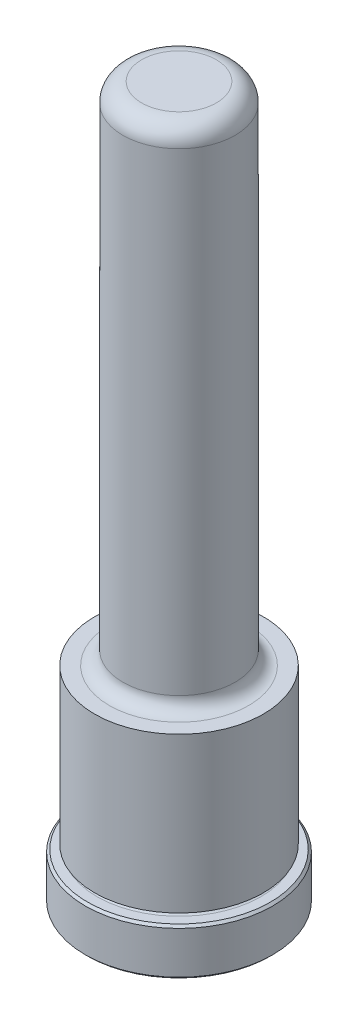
from build123d import *

# Parameters (mm, degrees)
CHAMFER1_SIZE = 0.381
FILLET1_R     = 3.175


with BuildPart() as part:
    # Sketch1 → Revolve1 (revolve)
    with BuildSketch(Plane(origin=(0, 0, 0), x_dir=(0, 0, -1), z_dir=(1, 0, 0)), mode=Mode.PRIVATE) as revolve1_sk:
        with BuildLine():
            Line((0, 0), (15.875, 0))
            Line((15.875, 0), (15.875, 7.9248))
            Line((15.875, 7.9248), (13.8938, 7.9248))
            ThreePointArc((13.8938, 7.9248), (13.5128, 8.3058), (13.8938, 8.6868))
            Line((13.8938, 8.6868), (14.3002, 8.6868))
            Line((14.3002, 8.6868), (14.3002, 34.925))
            Line((14.3002, 34.925), (11.7983, 34.925))
            ThreePointArc((11.7983, 34.925), (10.181853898, 35.594553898), (9.5123, 37.211))
            Line((9.5123, 37.211), (9.5123, 120.65))
            Line((9.5123, 120.65), (0, 120.65))
            Line((0, 120.65), (0, 0))
        make_face()
    revolve(revolve1_sk.sketch.rotate(Axis((0, 0, 0), (0, -1, 0)), 180), axis=Axis((0, 0, 0), (0, -1, 0)))

    # Chamfer1
    chamfer1_edges = [part.edges().sort_by_distance(p)[0] for p in [
        (0, 7.9248, -15.875),
        (0, 0, -15.875),
    ]]
    chamfer(chamfer1_edges, length=CHAMFER1_SIZE)

    # Fillet1
    fillet1_edges = [part.edges().sort_by_distance(p)[0] for p in [
        (0, 120.65, -9.5123),
    ]]
    fillet(fillet1_edges, radius=FILLET1_R)


solid = part.part
